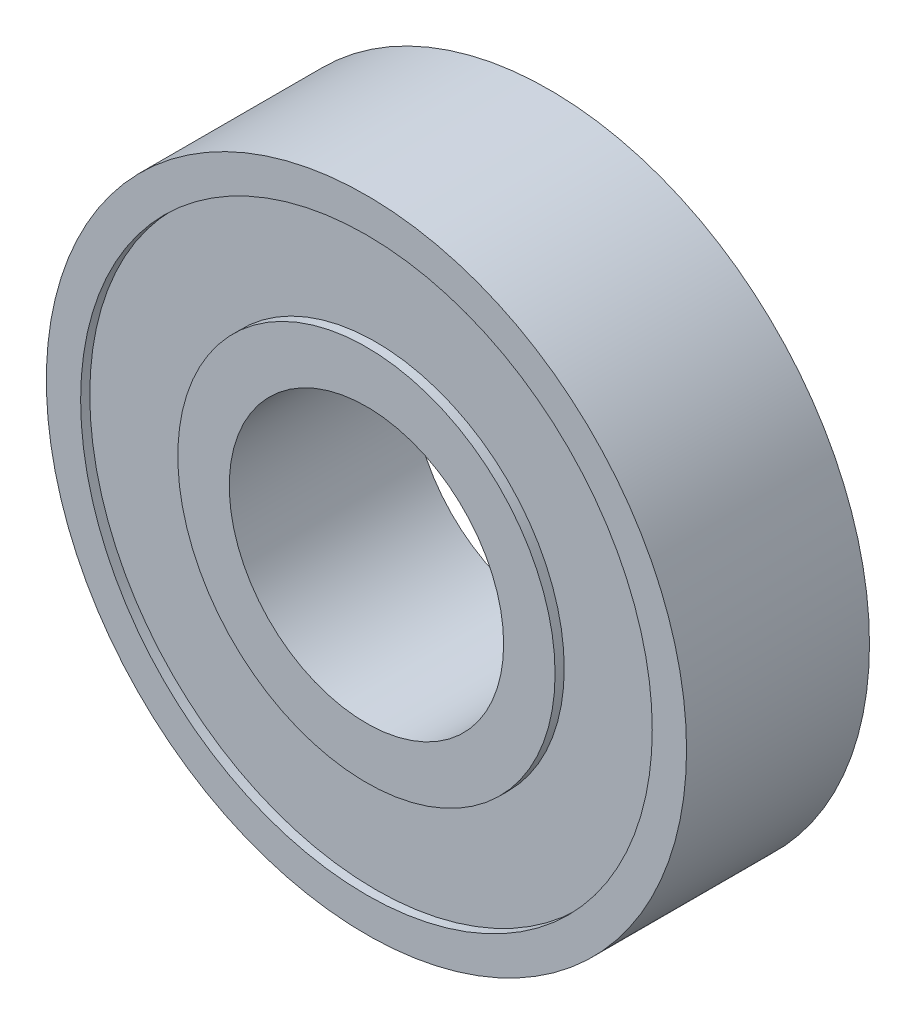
ISO-10303-21;
HEADER;
FILE_DESCRIPTION(('STEP AP214'),'2;1');
FILE_NAME('part.step','',(''),(''),'','','');
FILE_SCHEMA(('AUTOMOTIVE_DESIGN { 1 0 10303 214 1 1 1 1 }'));
ENDSEC;
DATA;
#1=APPLICATION_CONTEXT('core data for automotive mechanical design processes');
#2=APPLICATION_PROTOCOL_DEFINITION('international standard','automotive_design',2000,#1);
#3=PRODUCT_CONTEXT('',#1,'mechanical');
#4=PRODUCT('Part','Part','',(#3));
#5=PRODUCT_RELATED_PRODUCT_CATEGORY('part','',(#4));
#6=PRODUCT_DEFINITION_FORMATION('','',#4);
#7=PRODUCT_DEFINITION_CONTEXT('part definition',#1,'design');
#8=PRODUCT_DEFINITION('design','',#6,#7);
#9=PRODUCT_DEFINITION_SHAPE('','',#8);
#10=(LENGTH_UNIT() NAMED_UNIT(*) SI_UNIT(.MILLI.,.METRE.));
#11=(NAMED_UNIT(*) PLANE_ANGLE_UNIT() SI_UNIT($,.RADIAN.));
#12=(NAMED_UNIT(*) SI_UNIT($,.STERADIAN.) SOLID_ANGLE_UNIT());
#13=UNCERTAINTY_MEASURE_WITH_UNIT(LENGTH_MEASURE(1.E-05),#10,'distance_accuracy_value','');
#14=(GEOMETRIC_REPRESENTATION_CONTEXT(3) GLOBAL_UNCERTAINTY_ASSIGNED_CONTEXT((#13)) GLOBAL_UNIT_ASSIGNED_CONTEXT((#10,
#11,#12)) REPRESENTATION_CONTEXT('',''));
#15=CARTESIAN_POINT('',(0.,0.,0.));
#16=DIRECTION('',(0.,0.,1.));
#17=DIRECTION('',(1.,0.,0.));
#18=AXIS2_PLACEMENT_3D('',#15,#16,#17);
#19=CARTESIAN_POINT('',(0.,0.,-4.));
#20=DIRECTION('',(0.,0.,1.));
#21=DIRECTION('',(1.,0.,0.));
#22=AXIS2_PLACEMENT_3D('',#19,#20,#21);
#23=PLANE('',#22);
#24=CARTESIAN_POINT('',(0.,0.,-4.));
#25=DIRECTION('',(0.,0.,1.));
#26=DIRECTION('',(1.,0.,0.));
#27=AXIS2_PLACEMENT_3D('',#24,#25,#26);
#28=CIRCLE('',#27,14.);
#29=CARTESIAN_POINT('',(14.,0.,-4.));
#30=VERTEX_POINT('',#29);
#31=EDGE_CURVE('E34',#30,#30,#28,.T.);
#32=ORIENTED_EDGE('',*,*,#31,.F.);
#33=EDGE_LOOP('',(#32));
#34=FACE_BOUND('',#33,.T.);
#35=CARTESIAN_POINT('',(0.,0.,-4.));
#36=DIRECTION('',(0.,0.,1.));
#37=DIRECTION('',(1.,0.,0.));
#38=AXIS2_PLACEMENT_3D('',#35,#36,#37);
#39=CIRCLE('',#38,12.5);
#40=CARTESIAN_POINT('',(12.5,0.,-4.));
#41=VERTEX_POINT('',#40);
#42=EDGE_CURVE('E61',#41,#41,#39,.T.);
#43=ORIENTED_EDGE('',*,*,#42,.T.);
#44=EDGE_LOOP('',(#43));
#45=FACE_BOUND('',#44,.T.);
#46=ADVANCED_FACE('F30',(#34,#45),#23,.F.);
#47=CARTESIAN_POINT('',(0.,0.,4.));
#48=DIRECTION('',(0.,0.,1.));
#49=DIRECTION('',(1.,0.,0.));
#50=AXIS2_PLACEMENT_3D('',#47,#48,#49);
#51=PLANE('',#50);
#52=CARTESIAN_POINT('',(0.,0.,4.));
#53=DIRECTION('',(0.,0.,1.));
#54=DIRECTION('',(1.,0.,0.));
#55=AXIS2_PLACEMENT_3D('',#52,#53,#54);
#56=CIRCLE('',#55,6.);
#57=CARTESIAN_POINT('',(6.,0.,4.));
#58=VERTEX_POINT('',#57);
#59=EDGE_CURVE('E41',#58,#58,#56,.T.);
#60=ORIENTED_EDGE('',*,*,#59,.F.);
#61=EDGE_LOOP('',(#60));
#62=FACE_BOUND('',#61,.T.);
#63=CARTESIAN_POINT('',(0.,0.,4.));
#64=DIRECTION('',(0.,0.,1.));
#65=DIRECTION('',(1.,0.,0.));
#66=AXIS2_PLACEMENT_3D('',#63,#64,#65);
#67=CIRCLE('',#66,8.25);
#68=CARTESIAN_POINT('',(8.25,0.,4.));
#69=VERTEX_POINT('',#68);
#70=EDGE_CURVE('E55',#69,#69,#67,.T.);
#71=ORIENTED_EDGE('',*,*,#70,.T.);
#72=EDGE_LOOP('',(#71));
#73=FACE_BOUND('',#72,.T.);
#74=ADVANCED_FACE('F103',(#62,#73),#51,.T.);
#75=CARTESIAN_POINT('',(0.,0.,4.));
#76=DIRECTION('',(0.,0.,1.));
#77=DIRECTION('',(1.,0.,0.));
#78=AXIS2_PLACEMENT_3D('',#75,#76,#77);
#79=CIRCLE('',#78,12.5);
#80=CARTESIAN_POINT('',(12.5,0.,4.));
#81=VERTEX_POINT('',#80);
#82=EDGE_CURVE('E49',#81,#81,#79,.T.);
#83=ORIENTED_EDGE('',*,*,#82,.F.);
#84=EDGE_LOOP('',(#83));
#85=FACE_BOUND('',#84,.T.);
#86=CARTESIAN_POINT('',(0.,0.,4.));
#87=DIRECTION('',(0.,0.,1.));
#88=DIRECTION('',(1.,0.,0.));
#89=AXIS2_PLACEMENT_3D('',#86,#87,#88);
#90=CIRCLE('',#89,14.);
#91=CARTESIAN_POINT('',(14.,0.,4.));
#92=VERTEX_POINT('',#91);
#93=EDGE_CURVE('E10',#92,#92,#90,.T.);
#94=ORIENTED_EDGE('',*,*,#93,.T.);
#95=EDGE_LOOP('',(#94));
#96=FACE_BOUND('',#95,.T.);
#97=ADVANCED_FACE('F85',(#85,#96),#51,.T.);
#98=CARTESIAN_POINT('',(0.,0.,-4.));
#99=DIRECTION('',(0.,0.,1.));
#100=DIRECTION('',(1.,0.,0.));
#101=AXIS2_PLACEMENT_3D('',#98,#99,#100);
#102=CIRCLE('',#101,8.25);
#103=CARTESIAN_POINT('',(8.25,0.,-4.));
#104=VERTEX_POINT('',#103);
#105=EDGE_CURVE('E67',#104,#104,#102,.T.);
#106=ORIENTED_EDGE('',*,*,#105,.F.);
#107=EDGE_LOOP('',(#106));
#108=FACE_BOUND('',#107,.T.);
#109=CARTESIAN_POINT('',(0.,0.,-4.));
#110=DIRECTION('',(0.,0.,1.));
#111=DIRECTION('',(1.,0.,0.));
#112=AXIS2_PLACEMENT_3D('',#109,#110,#111);
#113=CIRCLE('',#112,6.);
#114=CARTESIAN_POINT('',(6.,0.,-4.));
#115=VERTEX_POINT('',#114);
#116=EDGE_CURVE('E43',#115,#115,#113,.T.);
#117=ORIENTED_EDGE('',*,*,#116,.T.);
#118=EDGE_LOOP('',(#117));
#119=FACE_BOUND('',#118,.T.);
#120=ADVANCED_FACE('F82',(#108,#119),#23,.F.);
#121=CARTESIAN_POINT('',(0.,0.,4.));
#122=DIRECTION('',(0.,0.,-1.));
#123=DIRECTION('',(-1.,0.,0.));
#124=AXIS2_PLACEMENT_3D('',#121,#122,#123);
#125=CYLINDRICAL_SURFACE('',#124,14.);
#126=ORIENTED_EDGE('',*,*,#93,.F.);
#127=EDGE_LOOP('',(#126));
#128=FACE_BOUND('',#127,.T.);
#129=ORIENTED_EDGE('',*,*,#31,.T.);
#130=EDGE_LOOP('',(#129));
#131=FACE_BOUND('',#130,.T.);
#132=ADVANCED_FACE('F32',(#128,#131),#125,.T.);
#133=CARTESIAN_POINT('',(0.,0.,4.));
#134=DIRECTION('',(0.,0.,-1.));
#135=DIRECTION('',(-1.,0.,0.));
#136=AXIS2_PLACEMENT_3D('',#133,#134,#135);
#137=CYLINDRICAL_SURFACE('',#136,6.);
#138=ORIENTED_EDGE('',*,*,#59,.T.);
#139=EDGE_LOOP('',(#138));
#140=FACE_BOUND('',#139,.T.);
#141=ORIENTED_EDGE('',*,*,#116,.F.);
#142=EDGE_LOOP('',(#141));
#143=FACE_BOUND('',#142,.T.);
#144=ADVANCED_FACE('F88',(#140,#143),#137,.F.);
#145=CARTESIAN_POINT('',(0.,0.,3.6));
#146=DIRECTION('',(0.,0.,1.));
#147=DIRECTION('',(1.,0.,0.));
#148=AXIS2_PLACEMENT_3D('',#145,#146,#147);
#149=CYLINDRICAL_SURFACE('',#148,12.5);
#150=CARTESIAN_POINT('',(0.,0.,3.6));
#151=DIRECTION('',(0.,0.,1.));
#152=DIRECTION('',(1.,0.,0.));
#153=AXIS2_PLACEMENT_3D('',#150,#151,#152);
#154=CIRCLE('',#153,12.5);
#155=CARTESIAN_POINT('',(12.5,0.,3.6));
#156=VERTEX_POINT('',#155);
#157=EDGE_CURVE('E46',#156,#156,#154,.T.);
#158=ORIENTED_EDGE('',*,*,#157,.F.);
#159=EDGE_LOOP('',(#158));
#160=FACE_BOUND('',#159,.T.);
#161=ORIENTED_EDGE('',*,*,#82,.T.);
#162=EDGE_LOOP('',(#161));
#163=FACE_BOUND('',#162,.T.);
#164=ADVANCED_FACE('F90',(#160,#163),#149,.F.);
#165=CARTESIAN_POINT('',(0.,0.,3.6));
#166=DIRECTION('',(0.,0.,1.));
#167=DIRECTION('',(1.,0.,0.));
#168=AXIS2_PLACEMENT_3D('',#165,#166,#167);
#169=PLANE('',#168);
#170=CARTESIAN_POINT('',(0.,0.,3.6));
#171=DIRECTION('',(0.,0.,1.));
#172=DIRECTION('',(1.,0.,0.));
#173=AXIS2_PLACEMENT_3D('',#170,#171,#172);
#174=CIRCLE('',#173,8.25);
#175=CARTESIAN_POINT('',(8.25,0.,3.6));
#176=VERTEX_POINT('',#175);
#177=EDGE_CURVE('E52',#176,#176,#174,.T.);
#178=ORIENTED_EDGE('',*,*,#177,.F.);
#179=EDGE_LOOP('',(#178));
#180=FACE_BOUND('',#179,.T.);
#181=ORIENTED_EDGE('',*,*,#157,.T.);
#182=EDGE_LOOP('',(#181));
#183=FACE_BOUND('',#182,.T.);
#184=ADVANCED_FACE('F97',(#180,#183),#169,.T.);
#185=CARTESIAN_POINT('',(0.,0.,3.6));
#186=DIRECTION('',(0.,0.,1.));
#187=DIRECTION('',(1.,0.,0.));
#188=AXIS2_PLACEMENT_3D('',#185,#186,#187);
#189=CYLINDRICAL_SURFACE('',#188,8.25);
#190=ORIENTED_EDGE('',*,*,#177,.T.);
#191=EDGE_LOOP('',(#190));
#192=FACE_BOUND('',#191,.T.);
#193=ORIENTED_EDGE('',*,*,#70,.F.);
#194=EDGE_LOOP('',(#193));
#195=FACE_BOUND('',#194,.T.);
#196=ADVANCED_FACE('F151',(#192,#195),#189,.T.);
#197=CARTESIAN_POINT('',(0.,0.,-3.6));
#198=DIRECTION('',(0.,0.,-1.));
#199=DIRECTION('',(1.,0.,0.));
#200=AXIS2_PLACEMENT_3D('',#197,#198,#199);
#201=PLANE('',#200);
#202=CARTESIAN_POINT('',(0.,0.,-3.6));
#203=DIRECTION('',(0.,0.,1.));
#204=DIRECTION('',(1.,0.,0.));
#205=AXIS2_PLACEMENT_3D('',#202,#203,#204);
#206=CIRCLE('',#205,12.5);
#207=CARTESIAN_POINT('',(12.5,0.,-3.6));
#208=VERTEX_POINT('',#207);
#209=EDGE_CURVE('E58',#208,#208,#206,.T.);
#210=ORIENTED_EDGE('',*,*,#209,.F.);
#211=EDGE_LOOP('',(#210));
#212=FACE_BOUND('',#211,.T.);
#213=CARTESIAN_POINT('',(0.,0.,-3.6));
#214=DIRECTION('',(0.,0.,1.));
#215=DIRECTION('',(1.,0.,0.));
#216=AXIS2_PLACEMENT_3D('',#213,#214,#215);
#217=CIRCLE('',#216,8.25);
#218=CARTESIAN_POINT('',(8.25,0.,-3.6));
#219=VERTEX_POINT('',#218);
#220=EDGE_CURVE('E64',#219,#219,#217,.T.);
#221=ORIENTED_EDGE('',*,*,#220,.T.);
#222=EDGE_LOOP('',(#221));
#223=FACE_BOUND('',#222,.T.);
#224=ADVANCED_FACE('F73',(#212,#223),#201,.T.);
#225=CARTESIAN_POINT('',(0.,0.,-3.6));
#226=DIRECTION('',(0.,0.,-1.));
#227=DIRECTION('',(-1.,0.,0.));
#228=AXIS2_PLACEMENT_3D('',#225,#226,#227);
#229=CYLINDRICAL_SURFACE('',#228,12.5);
#230=ORIENTED_EDGE('',*,*,#209,.T.);
#231=EDGE_LOOP('',(#230));
#232=FACE_BOUND('',#231,.T.);
#233=ORIENTED_EDGE('',*,*,#42,.F.);
#234=EDGE_LOOP('',(#233));
#235=FACE_BOUND('',#234,.T.);
#236=ADVANCED_FACE('F78',(#232,#235),#229,.F.);
#237=CARTESIAN_POINT('',(0.,0.,-3.6));
#238=DIRECTION('',(0.,0.,-1.));
#239=DIRECTION('',(-1.,0.,0.));
#240=AXIS2_PLACEMENT_3D('',#237,#238,#239);
#241=CYLINDRICAL_SURFACE('',#240,8.25);
#242=ORIENTED_EDGE('',*,*,#220,.F.);
#243=EDGE_LOOP('',(#242));
#244=FACE_BOUND('',#243,.T.);
#245=ORIENTED_EDGE('',*,*,#105,.T.);
#246=EDGE_LOOP('',(#245));
#247=FACE_BOUND('',#246,.T.);
#248=ADVANCED_FACE('F75',(#244,#247),#241,.T.);
#249=CLOSED_SHELL('',(#46,#74,#97,#120,#132,#144,#164,#184,#196,#224,#236,#248));
#250=MANIFOLD_SOLID_BREP('B2',#249);
#251=ADVANCED_BREP_SHAPE_REPRESENTATION('',(#18,#250),#14);
#252=SHAPE_DEFINITION_REPRESENTATION(#9,#251);
ENDSEC;
END-ISO-10303-21;
